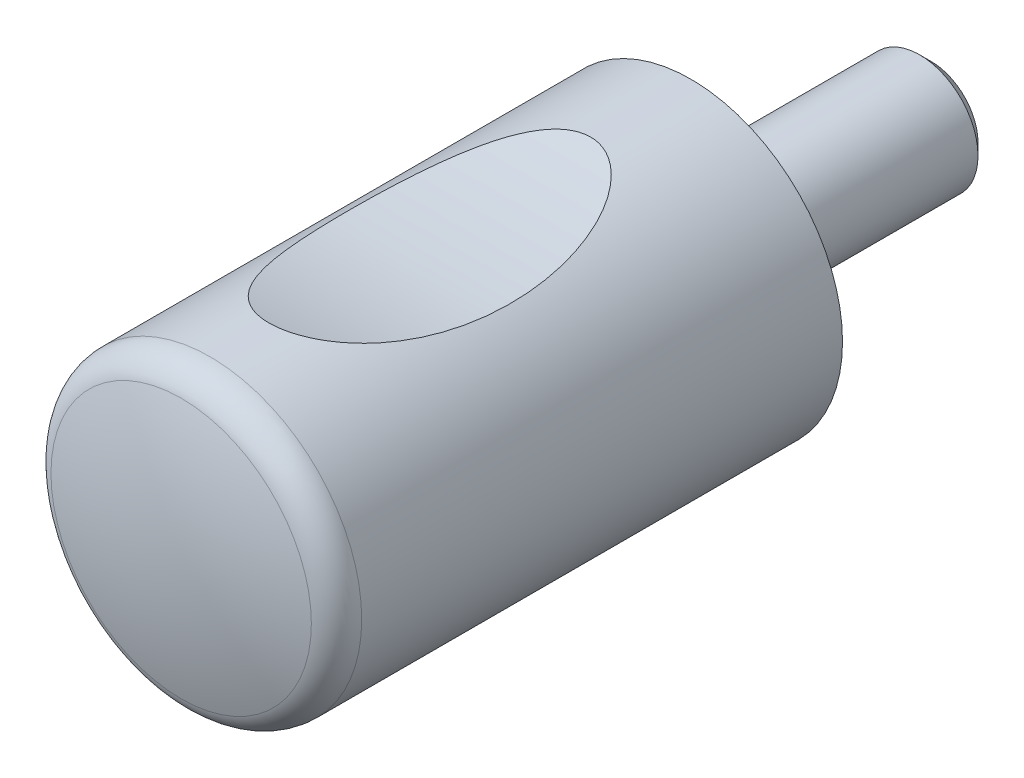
ISO-10303-21;
HEADER;
FILE_DESCRIPTION(('STEP AP214'),'2;1');
FILE_NAME('part.step','',(''),(''),'','','');
FILE_SCHEMA(('AUTOMOTIVE_DESIGN { 1 0 10303 214 1 1 1 1 }'));
ENDSEC;
DATA;
#1=APPLICATION_CONTEXT('core data for automotive mechanical design processes');
#2=APPLICATION_PROTOCOL_DEFINITION('international standard','automotive_design',2000,#1);
#3=PRODUCT_CONTEXT('',#1,'mechanical');
#4=PRODUCT('Part','Part','',(#3));
#5=PRODUCT_RELATED_PRODUCT_CATEGORY('part','',(#4));
#6=PRODUCT_DEFINITION_FORMATION('','',#4);
#7=PRODUCT_DEFINITION_CONTEXT('part definition',#1,'design');
#8=PRODUCT_DEFINITION('design','',#6,#7);
#9=PRODUCT_DEFINITION_SHAPE('','',#8);
#10=(LENGTH_UNIT() NAMED_UNIT(*) SI_UNIT(.MILLI.,.METRE.));
#11=(NAMED_UNIT(*) PLANE_ANGLE_UNIT() SI_UNIT($,.RADIAN.));
#12=(NAMED_UNIT(*) SI_UNIT($,.STERADIAN.) SOLID_ANGLE_UNIT());
#13=UNCERTAINTY_MEASURE_WITH_UNIT(LENGTH_MEASURE(1.E-05),#10,'distance_accuracy_value','');
#14=(GEOMETRIC_REPRESENTATION_CONTEXT(3) GLOBAL_UNCERTAINTY_ASSIGNED_CONTEXT((#13)) GLOBAL_UNIT_ASSIGNED_CONTEXT((#10,
#11,#12)) REPRESENTATION_CONTEXT('',''));
#15=CARTESIAN_POINT('',(0.,0.,0.));
#16=DIRECTION('',(0.,0.,1.));
#17=DIRECTION('',(1.,0.,0.));
#18=AXIS2_PLACEMENT_3D('',#15,#16,#17);
#19=CARTESIAN_POINT('',(0.,0.,23.));
#20=DIRECTION('',(0.,0.,1.));
#21=DIRECTION('',(1.,0.,0.));
#22=AXIS2_PLACEMENT_3D('',#19,#20,#21);
#23=CYLINDRICAL_SURFACE('',#22,6.5);
#24=CARTESIAN_POINT('',(0.,0.,20.916356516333));
#25=DIRECTION('',(0.,0.,1.));
#26=DIRECTION('',(1.,0.,0.));
#27=AXIS2_PLACEMENT_3D('',#24,#25,#26);
#28=CIRCLE('',#27,6.5);
#29=CARTESIAN_POINT('',(6.5,0.,20.916356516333));
#30=VERTEX_POINT('',#29);
#31=EDGE_CURVE('E188',#30,#30,#28,.T.);
#32=ORIENTED_EDGE('',*,*,#31,.F.);
#33=EDGE_LOOP('',(#32));
#34=FACE_BOUND('',#33,.T.);
#35=CARTESIAN_POINT('',(0.,-6.5,18.4));
#36=CARTESIAN_POINT('',(-0.115531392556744,-6.49999572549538,18.399988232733));
#37=CARTESIAN_POINT('',(-0.231125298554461,-6.49688153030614,18.3894938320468));
#38=CARTESIAN_POINT('',(-0.458423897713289,-6.48481797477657,18.3485443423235));
#39=CARTESIAN_POINT('',(-0.570123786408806,-6.47586165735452,18.3180654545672));
#40=CARTESIAN_POINT('',(-0.785793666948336,-6.45323298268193,18.2401488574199));
#41=CARTESIAN_POINT('',(-0.889817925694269,-6.43959858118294,18.1928475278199));
#42=CARTESIAN_POINT('',(-1.0896985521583,-6.40880655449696,18.084401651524));
#43=CARTESIAN_POINT('',(-1.18555212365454,-6.39164772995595,18.0232523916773));
#44=CARTESIAN_POINT('',(-1.42781079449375,-6.34310804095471,17.8470797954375));
#45=CARTESIAN_POINT('',(-1.56700173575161,-6.30968623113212,17.7227276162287));
#46=CARTESIAN_POINT('',(-1.8241387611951,-6.24022080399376,17.4542897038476));
#47=CARTESIAN_POINT('',(-1.94201763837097,-6.20416937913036,17.3101439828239));
#48=CARTESIAN_POINT('',(-2.14370437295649,-6.13710923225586,17.0300739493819));
#49=CARTESIAN_POINT('',(-2.22997335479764,-6.10611095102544,16.8958860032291));
#50=CARTESIAN_POINT('',(-2.39057992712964,-6.04504073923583,16.6202833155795));
#51=CARTESIAN_POINT('',(-2.46490873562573,-6.01496950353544,16.4788633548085));
#52=CARTESIAN_POINT('',(-2.60316489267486,-5.95643933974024,16.1905074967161));
#53=CARTESIAN_POINT('',(-2.66707785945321,-5.92798267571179,16.0435643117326));
#54=CARTESIAN_POINT('',(-2.78563730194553,-5.87319935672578,15.7455781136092));
#55=CARTESIAN_POINT('',(-2.84028048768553,-5.84687345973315,15.5945336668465));
#56=CARTESIAN_POINT('',(-2.98117382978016,-5.77692721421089,15.1689394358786));
#57=CARTESIAN_POINT('',(-3.05836928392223,-5.73603934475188,14.890921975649));
#58=CARTESIAN_POINT('',(-3.19072604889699,-5.66346974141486,14.328456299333));
#59=CARTESIAN_POINT('',(-3.24587054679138,-5.63179503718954,14.0440033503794));
#60=CARTESIAN_POINT('',(-3.33697489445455,-5.57829621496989,13.4705213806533));
#61=CARTESIAN_POINT('',(-3.37289285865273,-5.55649361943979,13.1814837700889));
#62=CARTESIAN_POINT('',(-3.42709645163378,-5.52322412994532,12.6012854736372));
#63=CARTESIAN_POINT('',(-3.44538698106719,-5.51175436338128,12.3101254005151));
#64=CARTESIAN_POINT('',(-3.46588728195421,-5.49889003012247,11.7072838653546));
#65=CARTESIAN_POINT('',(-3.46692559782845,-5.49822947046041,11.3955465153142));
#66=CARTESIAN_POINT('',(-3.44996569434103,-5.50888708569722,10.7726957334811));
#67=CARTESIAN_POINT('',(-3.43196163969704,-5.52020893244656,10.4615825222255));
#68=CARTESIAN_POINT('',(-3.37604581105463,-5.55458381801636,9.84291034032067));
#69=CARTESIAN_POINT('',(-3.33820666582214,-5.57759404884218,9.53534255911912));
#70=CARTESIAN_POINT('',(-3.240620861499,-5.63485565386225,8.92491898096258));
#71=CARTESIAN_POINT('',(-3.18088891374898,-5.66909947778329,8.62206016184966));
#72=CARTESIAN_POINT('',(-3.04130599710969,-5.74511613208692,8.04556476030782));
#73=CARTESIAN_POINT('',(-2.96324568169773,-5.78615527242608,7.77141079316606));
#74=CARTESIAN_POINT('',(-2.8264676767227,-5.85351346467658,7.36743393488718));
#75=CARTESIAN_POINT('',(-2.77751012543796,-5.87697024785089,7.23379930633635));
#76=CARTESIAN_POINT('',(-2.67229915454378,-5.92555400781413,6.96976033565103));
#77=CARTESIAN_POINT('',(-2.61604778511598,-5.95068051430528,6.83935509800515));
#78=CARTESIAN_POINT('',(-2.49459620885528,-6.00261688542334,6.58093717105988));
#79=CARTESIAN_POINT('',(-2.42928830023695,-6.02944450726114,6.45297830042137));
#80=CARTESIAN_POINT('',(-2.28920127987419,-6.08401313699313,6.20243063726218));
#81=CARTESIAN_POINT('',(-2.21441806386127,-6.11175453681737,6.0798442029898));
#82=CARTESIAN_POINT('',(-2.05454566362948,-6.16733129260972,5.84240042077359));
#83=CARTESIAN_POINT('',(-1.96950647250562,-6.19516559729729,5.72750951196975));
#84=CARTESIAN_POINT('',(-1.78762697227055,-6.25007237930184,5.50740131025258));
#85=CARTESIAN_POINT('',(-1.69080293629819,-6.27714584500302,5.40217102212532));
#86=CARTESIAN_POINT('',(-1.49396390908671,-6.32671731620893,5.21415856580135));
#87=CARTESIAN_POINT('',(-1.39514259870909,-6.34940519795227,5.13019169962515));
#88=CARTESIAN_POINT('',(-1.1862806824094,-6.39171931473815,4.97637545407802));
#89=CARTESIAN_POINT('',(-1.07624010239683,-6.41134555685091,4.90652604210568));
#90=CARTESIAN_POINT('',(-0.844075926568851,-6.44604093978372,4.7846335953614));
#91=CARTESIAN_POINT('',(-0.721822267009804,-6.46105208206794,4.7328161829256));
#92=CARTESIAN_POINT('',(-0.469126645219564,-6.48428070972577,4.65318609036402));
#93=CARTESIAN_POINT('',(-0.338700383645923,-6.49251081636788,4.62532880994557));
#94=CARTESIAN_POINT('',(-0.0910843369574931,-6.50039290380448,4.5986615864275));
#95=CARTESIAN_POINT('',(0.0257342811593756,-6.5009844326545,4.59666995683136));
#96=CARTESIAN_POINT('',(0.257679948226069,-6.49592582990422,4.6137700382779));
#97=CARTESIAN_POINT('',(0.37280676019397,-6.49027483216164,4.63286467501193));
#98=CARTESIAN_POINT('',(0.586741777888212,-6.47426816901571,4.68746218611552));
#99=CARTESIAN_POINT('',(0.686052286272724,-6.46441947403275,4.72120265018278));
#100=CARTESIAN_POINT('',(0.878533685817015,-6.44108596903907,4.8020659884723));
#101=CARTESIAN_POINT('',(0.971703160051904,-6.42760032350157,4.84919193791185));
#102=CARTESIAN_POINT('',(1.20205343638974,-6.38947674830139,4.9843592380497));
#103=CARTESIAN_POINT('',(1.33418007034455,-6.36285470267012,5.08043782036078));
#104=CARTESIAN_POINT('',(1.58128974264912,-6.30600619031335,5.29175320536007));
#105=CARTESIAN_POINT('',(1.69622197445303,-6.27576949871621,5.40704473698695));
#106=CARTESIAN_POINT('',(1.89109822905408,-6.21949148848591,5.62909492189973));
#107=CARTESIAN_POINT('',(1.97362288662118,-6.19366770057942,5.73368844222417));
#108=CARTESIAN_POINT('',(2.12914925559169,-6.14194176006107,5.94977060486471));
#109=CARTESIAN_POINT('',(2.20214457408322,-6.11603956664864,6.06126380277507));
#110=CARTESIAN_POINT('',(2.33966386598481,-6.06476402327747,6.28963163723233));
#111=CARTESIAN_POINT('',(2.40417684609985,-6.03939139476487,6.40651299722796));
#112=CARTESIAN_POINT('',(2.52555370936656,-5.9896466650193,6.64440860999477));
#113=CARTESIAN_POINT('',(2.58241471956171,-5.96527494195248,6.7654243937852));
#114=CARTESIAN_POINT('',(2.73286855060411,-5.89854030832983,7.11074906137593));
#115=CARTESIAN_POINT('',(2.8185936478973,-5.85771673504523,7.33880024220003));
#116=CARTESIAN_POINT('',(2.9711789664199,-5.78180786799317,7.80209100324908));
#117=CARTESIAN_POINT('',(3.03802434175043,-5.74672709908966,8.03733608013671));
#118=CARTESIAN_POINT('',(3.15559571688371,-5.68301789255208,8.51323544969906));
#119=CARTESIAN_POINT('',(3.20628365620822,-5.6544047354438,8.75390110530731));
#120=CARTESIAN_POINT('',(3.29322735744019,-5.60420781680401,9.23856138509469));
#121=CARTESIAN_POINT('',(3.32947946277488,-5.58262583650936,9.48255683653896));
#122=CARTESIAN_POINT('',(3.40201972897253,-5.5388491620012,10.0813354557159));
#123=CARTESIAN_POINT('',(3.43120135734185,-5.52062313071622,10.4372872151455));
#124=CARTESIAN_POINT('',(3.46433942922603,-5.49988126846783,11.1509701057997));
#125=CARTESIAN_POINT('',(3.46828081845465,-5.49737481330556,11.5087021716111));
#126=CARTESIAN_POINT('',(3.45117940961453,-5.50812699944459,12.2226366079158));
#127=CARTESIAN_POINT('',(3.43018532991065,-5.52135489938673,12.5788406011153));
#128=CARTESIAN_POINT('',(3.36185664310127,-5.56323646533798,13.2876584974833));
#129=CARTESIAN_POINT('',(3.31454205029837,-5.59187840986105,13.6402749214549));
#130=CARTESIAN_POINT('',(3.22066485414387,-5.64611269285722,14.1670529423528));
#131=CARTESIAN_POINT('',(3.18514900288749,-5.666292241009,14.3437924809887));
#132=CARTESIAN_POINT('',(3.1056585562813,-5.7102511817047,14.6948966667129));
#133=CARTESIAN_POINT('',(3.06168564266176,-5.73402985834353,14.8692617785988));
#134=CARTESIAN_POINT('',(2.96437631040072,-5.78493612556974,15.2148434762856));
#135=CARTESIAN_POINT('',(2.91104153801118,-5.81206312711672,15.3860606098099));
#136=CARTESIAN_POINT('',(2.79383147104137,-5.86930768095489,15.7243403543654));
#137=CARTESIAN_POINT('',(2.72995867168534,-5.89942452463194,15.8914039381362));
#138=CARTESIAN_POINT('',(2.60822191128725,-5.95402340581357,16.177536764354));
#139=CARTESIAN_POINT('',(2.55306359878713,-5.97795294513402,16.2978620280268));
#140=CARTESIAN_POINT('',(2.4353820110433,-6.02685485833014,16.5346237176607));
#141=CARTESIAN_POINT('',(2.37286077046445,-6.05182694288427,16.6510612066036));
#142=CARTESIAN_POINT('',(2.2396854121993,-6.10236647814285,16.8788258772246));
#143=CARTESIAN_POINT('',(2.16904497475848,-6.12793287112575,16.9901612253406));
#144=CARTESIAN_POINT('',(2.01861818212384,-6.17911703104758,17.2064012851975));
#145=CARTESIAN_POINT('',(1.93883775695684,-6.20473475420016,17.3113100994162));
#146=CARTESIAN_POINT('',(1.75644161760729,-6.259016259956,17.5277580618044));
#147=CARTESIAN_POINT('',(1.65219404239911,-6.28756830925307,17.6379729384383));
#148=CARTESIAN_POINT('',(1.42882490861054,-6.34205252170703,17.8430555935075));
#149=CARTESIAN_POINT('',(1.30971893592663,-6.36798737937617,17.9379392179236));
#150=CARTESIAN_POINT('',(1.08146512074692,-6.41023246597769,18.0895990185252));
#151=CARTESIAN_POINT('',(0.975050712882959,-6.42743097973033,18.1502010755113));
#152=CARTESIAN_POINT('',(0.75338345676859,-6.45715343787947,18.2538146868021));
#153=CARTESIAN_POINT('',(0.63814809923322,-6.46968635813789,18.2968600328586));
#154=CARTESIAN_POINT('',(0.435365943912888,-6.48595768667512,18.3524353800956));
#155=CARTESIAN_POINT('',(0.349355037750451,-6.49118740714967,18.3701762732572));
#156=CARTESIAN_POINT('',(0.175574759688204,-6.49821014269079,18.3939629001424));
#157=CARTESIAN_POINT('',(0.0878054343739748,-6.50000324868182,18.4000089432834));
#158=CARTESIAN_POINT('',(0.,-6.5,18.4));
#159=B_SPLINE_CURVE_WITH_KNOTS('',3,(#35,#36,#37,#38,#39,#40,#41,#42,#43,#44,#45,#46,#47,#48,
#49,#50,#51,#52,#53,#54,#55,#56,#57,#58,#59,#60,#61,#62,#63,#64,#65,#66,#67,#68,#69,#70,#71,#72,
#73,#74,#75,#76,#77,#78,#79,#80,#81,#82,#83,#84,#85,#86,#87,#88,#89,#90,#91,#92,#93,#94,#95,#96,
#97,#98,#99,#100,#101,#102,#103,#104,#105,#106,#107,#108,#109,#110,#111,#112,#113,#114,#115,
#116,#117,#118,#119,#120,#121,#122,#123,#124,#125,#126,#127,#128,#129,#130,#131,#132,#133,#134,
#135,#136,#137,#138,#139,#140,#141,#142,#143,#144,#145,#146,#147,#148,#149,#150,#151,#152,#153,
#154,#155,#156,#157,#158),.UNSPECIFIED.,.T.,.F.,(4,2,2,2,2,2,2,2,2,2,2,2,2,2,2,2,2,2,2,2,2,2,2,
2,2,2,2,2,2,2,2,2,2,2,2,2,2,2,2,2,2,2,2,2,2,2,2,2,2,2,2,2,2,2,2,2,2,2,2,2,2,4),(0.,
0.346216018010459,0.692845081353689,1.03672578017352,1.38072369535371,1.94632898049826,
2.51368790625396,3.00052953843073,3.48772761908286,3.97559280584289,4.46363078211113,
5.33651682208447,6.21006713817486,7.08551284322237,7.96071509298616,8.89511936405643,
9.82981005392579,10.7611019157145,11.6917691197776,12.5543797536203,12.9869159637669,
13.4193308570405,13.8574176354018,14.2956948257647,14.7319159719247,15.1675414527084,
15.5614466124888,15.9553508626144,16.3540201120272,16.7519456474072,17.1003818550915,
17.4488664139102,17.7637013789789,18.0786087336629,18.5723523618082,19.0675272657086,
19.4740891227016,19.8809223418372,20.2882777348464,20.6957856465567,21.4356719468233,
22.1761384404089,22.9183365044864,23.660722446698,24.7321719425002,25.8042604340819,
26.8742577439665,27.9434425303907,28.4874394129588,29.0313282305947,29.5751215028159,
30.1187861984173,30.5220986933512,30.9252999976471,31.3278316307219,31.7301035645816,
32.1920373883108,32.6534906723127,33.0231346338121,33.3920637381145,33.6551995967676,
33.9183284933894),.UNSPECIFIED.);
#160=CARTESIAN_POINT('',(0.,-6.5,18.4));
#161=VERTEX_POINT('',#160);
#162=EDGE_CURVE('E9',#161,#161,#159,.T.);
#163=ORIENTED_EDGE('',*,*,#162,.F.);
#164=EDGE_LOOP('',(#163));
#165=FACE_BOUND('',#164,.T.);
#166=CARTESIAN_POINT('',(0.,6.5,4.6));
#167=CARTESIAN_POINT('',(-0.115531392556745,6.49999572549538,4.60001176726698));
#168=CARTESIAN_POINT('',(-0.231125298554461,6.49688153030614,4.61050616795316));
#169=CARTESIAN_POINT('',(-0.458423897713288,6.48481797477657,4.65145565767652));
#170=CARTESIAN_POINT('',(-0.570123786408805,6.47586165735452,4.68193454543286));
#171=CARTESIAN_POINT('',(-0.785793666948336,6.45323298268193,4.75985114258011));
#172=CARTESIAN_POINT('',(-0.889817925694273,6.43959858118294,4.80715247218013));
#173=CARTESIAN_POINT('',(-1.0896985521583,6.40880655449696,4.91559834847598));
#174=CARTESIAN_POINT('',(-1.18555212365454,6.39164772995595,4.97674760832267));
#175=CARTESIAN_POINT('',(-1.42781079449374,6.34310804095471,5.15292020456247));
#176=CARTESIAN_POINT('',(-1.5670017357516,6.30968623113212,5.27727238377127));
#177=CARTESIAN_POINT('',(-1.8241387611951,6.24022080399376,5.54571029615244));
#178=CARTESIAN_POINT('',(-1.94201763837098,6.20416937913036,5.68985601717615));
#179=CARTESIAN_POINT('',(-2.1437043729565,6.13710923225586,5.96992605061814));
#180=CARTESIAN_POINT('',(-2.22997335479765,6.10611095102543,6.10411399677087));
#181=CARTESIAN_POINT('',(-2.39057992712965,6.04504073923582,6.37971668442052));
#182=CARTESIAN_POINT('',(-2.46490873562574,6.01496950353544,6.52113664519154));
#183=CARTESIAN_POINT('',(-2.60316489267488,5.95643933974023,6.80949250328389));
#184=CARTESIAN_POINT('',(-2.66707785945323,5.92798267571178,6.95643568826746));
#185=CARTESIAN_POINT('',(-2.78563730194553,5.87319935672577,7.25442188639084));
#186=CARTESIAN_POINT('',(-2.84028048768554,5.84687345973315,7.40546633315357));
#187=CARTESIAN_POINT('',(-2.98117382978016,5.77692721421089,7.83106056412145));
#188=CARTESIAN_POINT('',(-3.05836928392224,5.73603934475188,8.10907802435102));
#189=CARTESIAN_POINT('',(-3.190726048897,5.66346974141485,8.67154370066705));
#190=CARTESIAN_POINT('',(-3.24587054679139,5.63179503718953,8.95599664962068));
#191=CARTESIAN_POINT('',(-3.33697489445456,5.57829621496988,9.52947861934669));
#192=CARTESIAN_POINT('',(-3.37289285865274,5.55649361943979,9.81851622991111));
#193=CARTESIAN_POINT('',(-3.42709645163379,5.52322412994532,10.3987145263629));
#194=CARTESIAN_POINT('',(-3.44538698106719,5.51175436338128,10.689874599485));
#195=CARTESIAN_POINT('',(-3.46588728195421,5.49889003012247,11.2927161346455));
#196=CARTESIAN_POINT('',(-3.46692559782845,5.49822947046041,11.6044534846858));
#197=CARTESIAN_POINT('',(-3.44996569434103,5.50888708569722,12.2273042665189));
#198=CARTESIAN_POINT('',(-3.43196163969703,5.52020893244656,12.5384174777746));
#199=CARTESIAN_POINT('',(-3.37604581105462,5.55458381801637,13.1570896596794));
#200=CARTESIAN_POINT('',(-3.33820666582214,5.57759404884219,13.4646574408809));
#201=CARTESIAN_POINT('',(-3.240620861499,5.63485565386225,14.0750810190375));
#202=CARTESIAN_POINT('',(-3.18088891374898,5.66909947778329,14.3779398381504));
#203=CARTESIAN_POINT('',(-3.04130599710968,5.74511613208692,14.9544352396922));
#204=CARTESIAN_POINT('',(-2.96324568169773,5.78615527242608,15.228589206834));
#205=CARTESIAN_POINT('',(-2.8264676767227,5.85351346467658,15.6325660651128));
#206=CARTESIAN_POINT('',(-2.77751012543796,5.87697024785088,15.7662006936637));
#207=CARTESIAN_POINT('',(-2.67229915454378,5.92555400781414,16.030239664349));
#208=CARTESIAN_POINT('',(-2.61604778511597,5.95068051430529,16.1606449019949));
#209=CARTESIAN_POINT('',(-2.49459620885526,6.00261688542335,16.4190628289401));
#210=CARTESIAN_POINT('',(-2.42928830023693,6.02944450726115,16.5470216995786));
#211=CARTESIAN_POINT('',(-2.28920127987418,6.08401313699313,16.7975693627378));
#212=CARTESIAN_POINT('',(-2.21441806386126,6.11175453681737,16.9201557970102));
#213=CARTESIAN_POINT('',(-2.05454566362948,6.16733129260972,17.1575995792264));
#214=CARTESIAN_POINT('',(-1.96950647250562,6.19516559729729,17.2724904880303));
#215=CARTESIAN_POINT('',(-1.78762697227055,6.25007237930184,17.4925986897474));
#216=CARTESIAN_POINT('',(-1.69080293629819,6.27714584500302,17.5978289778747));
#217=CARTESIAN_POINT('',(-1.49396390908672,6.32671731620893,17.7858414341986));
#218=CARTESIAN_POINT('',(-1.3951425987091,6.34940519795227,17.8698083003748));
#219=CARTESIAN_POINT('',(-1.1862806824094,6.39171931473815,18.023624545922));
#220=CARTESIAN_POINT('',(-1.07624010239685,6.41134555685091,18.0934739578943));
#221=CARTESIAN_POINT('',(-0.844075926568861,6.44604093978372,18.2153664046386));
#222=CARTESIAN_POINT('',(-0.721822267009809,6.46105208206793,18.2671838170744));
#223=CARTESIAN_POINT('',(-0.469126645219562,6.48428070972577,18.346813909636));
#224=CARTESIAN_POINT('',(-0.33870038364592,6.49251081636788,18.3746711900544));
#225=CARTESIAN_POINT('',(-0.09108433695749,6.50039290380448,18.4013384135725));
#226=CARTESIAN_POINT('',(0.0257342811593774,6.5009844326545,18.4033300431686));
#227=CARTESIAN_POINT('',(0.257679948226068,6.49592582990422,18.3862299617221));
#228=CARTESIAN_POINT('',(0.372806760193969,6.49027483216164,18.3671353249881));
#229=CARTESIAN_POINT('',(0.586741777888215,6.47426816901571,18.3125378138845));
#230=CARTESIAN_POINT('',(0.686052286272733,6.46441947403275,18.2787973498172));
#231=CARTESIAN_POINT('',(0.878533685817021,6.44108596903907,18.1979340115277));
#232=CARTESIAN_POINT('',(0.971703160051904,6.42760032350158,18.1508080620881));
#233=CARTESIAN_POINT('',(1.20205343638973,6.3894767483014,18.0156407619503));
#234=CARTESIAN_POINT('',(1.33418007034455,6.36285470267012,17.9195621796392));
#235=CARTESIAN_POINT('',(1.58128974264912,6.30600619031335,17.7082467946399));
#236=CARTESIAN_POINT('',(1.69622197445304,6.27576949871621,17.592955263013));
#237=CARTESIAN_POINT('',(1.89109822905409,6.21949148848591,17.3709050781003));
#238=CARTESIAN_POINT('',(1.97362288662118,6.19366770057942,17.2663115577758));
#239=CARTESIAN_POINT('',(2.12914925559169,6.14194176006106,17.0502293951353));
#240=CARTESIAN_POINT('',(2.20214457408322,6.11603956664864,16.9387361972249));
#241=CARTESIAN_POINT('',(2.33966386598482,6.06476402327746,16.7103683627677));
#242=CARTESIAN_POINT('',(2.40417684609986,6.03939139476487,16.593487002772));
#243=CARTESIAN_POINT('',(2.52555370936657,5.9896466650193,16.3555913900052));
#244=CARTESIAN_POINT('',(2.5824147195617,5.96527494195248,16.2345756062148));
#245=CARTESIAN_POINT('',(2.7328685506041,5.89854030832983,15.8892509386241));
#246=CARTESIAN_POINT('',(2.81859364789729,5.85771673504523,15.6611997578));
#247=CARTESIAN_POINT('',(2.9711789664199,5.78180786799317,15.1979089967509));
#248=CARTESIAN_POINT('',(3.03802434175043,5.74672709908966,14.9626639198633));
#249=CARTESIAN_POINT('',(3.15559571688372,5.68301789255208,14.4867645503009));
#250=CARTESIAN_POINT('',(3.20628365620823,5.65440473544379,14.2460988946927));
#251=CARTESIAN_POINT('',(3.29322735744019,5.60420781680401,13.7614386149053));
#252=CARTESIAN_POINT('',(3.32947946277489,5.58262583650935,13.517443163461));
#253=CARTESIAN_POINT('',(3.40201972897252,5.53884916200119,12.9186645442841));
#254=CARTESIAN_POINT('',(3.43120135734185,5.52062313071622,12.5627127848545));
#255=CARTESIAN_POINT('',(3.46433942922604,5.49988126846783,11.8490298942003));
#256=CARTESIAN_POINT('',(3.46828081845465,5.49737481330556,11.4912978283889));
#257=CARTESIAN_POINT('',(3.45117940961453,5.50812699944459,10.7773633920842));
#258=CARTESIAN_POINT('',(3.43018532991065,5.52135489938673,10.4211593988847));
#259=CARTESIAN_POINT('',(3.36185664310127,5.56323646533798,9.71234150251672));
#260=CARTESIAN_POINT('',(3.31454205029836,5.59187840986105,9.35972507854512));
#261=CARTESIAN_POINT('',(3.22066485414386,5.64611269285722,8.83294705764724));
#262=CARTESIAN_POINT('',(3.18514900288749,5.666292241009,8.65620751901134));
#263=CARTESIAN_POINT('',(3.1056585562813,5.7102511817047,8.3051033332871));
#264=CARTESIAN_POINT('',(3.06168564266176,5.73402985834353,8.13073822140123));
#265=CARTESIAN_POINT('',(2.96437631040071,5.78493612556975,7.78515652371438));
#266=CARTESIAN_POINT('',(2.91104153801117,5.81206312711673,7.61393939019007));
#267=CARTESIAN_POINT('',(2.79383147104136,5.86930768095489,7.27565964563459));
#268=CARTESIAN_POINT('',(2.72995867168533,5.89942452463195,7.10859606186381));
#269=CARTESIAN_POINT('',(2.60822191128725,5.95402340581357,6.82246323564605));
#270=CARTESIAN_POINT('',(2.55306359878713,5.97795294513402,6.70213797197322));
#271=CARTESIAN_POINT('',(2.4353820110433,6.02685485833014,6.46537628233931));
#272=CARTESIAN_POINT('',(2.37286077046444,6.05182694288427,6.34893879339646));
#273=CARTESIAN_POINT('',(2.2396854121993,6.10236647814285,6.12117412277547));
#274=CARTESIAN_POINT('',(2.16904497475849,6.12793287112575,6.00983877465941));
#275=CARTESIAN_POINT('',(2.01861818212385,6.17911703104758,5.79359871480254));
#276=CARTESIAN_POINT('',(1.93883775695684,6.20473475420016,5.68868990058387));
#277=CARTESIAN_POINT('',(1.75644161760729,6.259016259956,5.47224193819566));
#278=CARTESIAN_POINT('',(1.65219404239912,6.28756830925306,5.36202706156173));
#279=CARTESIAN_POINT('',(1.42882490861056,6.34205252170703,5.15694440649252));
#280=CARTESIAN_POINT('',(1.30971893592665,6.36798737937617,5.06206078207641));
#281=CARTESIAN_POINT('',(1.08146512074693,6.41023246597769,4.91040098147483));
#282=CARTESIAN_POINT('',(0.975050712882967,6.42743097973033,4.84979892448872));
#283=CARTESIAN_POINT('',(0.753383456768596,6.45715343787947,4.74618531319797));
#284=CARTESIAN_POINT('',(0.638148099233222,6.46968635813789,4.70313996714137));
#285=CARTESIAN_POINT('',(0.435365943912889,6.48595768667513,4.64756461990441));
#286=CARTESIAN_POINT('',(0.349355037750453,6.49118740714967,4.62982372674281));
#287=CARTESIAN_POINT('',(0.175574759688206,6.49821014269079,4.60603709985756));
#288=CARTESIAN_POINT('',(0.0878054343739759,6.50000324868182,4.59999105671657));
#289=CARTESIAN_POINT('',(0.,6.5,4.6));
#290=B_SPLINE_CURVE_WITH_KNOTS('',3,(#166,#167,#168,#169,#170,#171,#172,#173,#174,#175,#176,
#177,#178,#179,#180,#181,#182,#183,#184,#185,#186,#187,#188,#189,#190,#191,#192,#193,#194,#195,
#196,#197,#198,#199,#200,#201,#202,#203,#204,#205,#206,#207,#208,#209,#210,#211,#212,#213,#214,
#215,#216,#217,#218,#219,#220,#221,#222,#223,#224,#225,#226,#227,#228,#229,#230,#231,#232,#233,
#234,#235,#236,#237,#238,#239,#240,#241,#242,#243,#244,#245,#246,#247,#248,#249,#250,#251,#252,
#253,#254,#255,#256,#257,#258,#259,#260,#261,#262,#263,#264,#265,#266,#267,#268,#269,#270,#271,
#272,#273,#274,#275,#276,#277,#278,#279,#280,#281,#282,#283,#284,#285,#286,#287,#288,#289),
.UNSPECIFIED.,.T.,.F.,(4,2,2,2,2,2,2,2,2,2,2,2,2,2,2,2,2,2,2,2,2,2,2,2,2,2,2,2,2,2,2,2,2,2,2,2,
2,2,2,2,2,2,2,2,2,2,2,2,2,2,2,2,2,2,2,2,2,2,2,2,2,4),(0.,0.346216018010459,0.692845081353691,
1.03672578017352,1.38072369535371,1.94632898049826,2.51368790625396,3.00052953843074,
3.48772761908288,3.97559280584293,4.46363078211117,5.33651682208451,6.2100671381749,
7.08551284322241,7.96071509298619,8.89511936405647,9.82981005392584,10.7611019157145,
11.6917691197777,12.5543797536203,12.9869159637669,13.4193308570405,13.8574176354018,
14.2956948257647,14.7319159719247,15.1675414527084,15.5614466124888,15.9553508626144,
16.3540201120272,16.7519456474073,17.1003818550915,17.4488664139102,17.7637013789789,
18.0786087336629,18.5723523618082,19.0675272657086,19.4740891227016,19.8809223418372,
20.2882777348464,20.6957856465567,21.4356719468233,22.1761384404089,22.9183365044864,
23.660722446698,24.7321719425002,25.804260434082,26.8742577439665,27.9434425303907,
28.4874394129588,29.0313282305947,29.5751215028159,30.1187861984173,30.5220986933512,
30.9252999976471,31.3278316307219,31.7301035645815,32.1920373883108,32.6534906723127,
33.0231346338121,33.3920637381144,33.6551995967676,33.9183284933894),.UNSPECIFIED.);
#291=CARTESIAN_POINT('',(0.,6.5,4.6));
#292=VERTEX_POINT('',#291);
#293=EDGE_CURVE('E27',#292,#292,#290,.T.);
#294=ORIENTED_EDGE('',*,*,#293,.F.);
#295=EDGE_LOOP('',(#294));
#296=FACE_BOUND('',#295,.T.);
#297=CARTESIAN_POINT('',(0.,0.,0.3));
#298=DIRECTION('',(0.,0.,1.));
#299=DIRECTION('',(1.,0.,0.));
#300=AXIS2_PLACEMENT_3D('',#297,#298,#299);
#301=CIRCLE('',#300,6.5);
#302=CARTESIAN_POINT('',(6.5,0.,0.3));
#303=VERTEX_POINT('',#302);
#304=EDGE_CURVE('E191',#303,#303,#301,.T.);
#305=ORIENTED_EDGE('',*,*,#304,.T.);
#306=EDGE_LOOP('',(#305));
#307=FACE_BOUND('',#306,.T.);
#308=ADVANCED_FACE('F14',(#34,#165,#296,#307),#23,.T.);
#309=CARTESIAN_POINT('',(0.,0.,-7.5));
#310=DIRECTION('',(0.,0.,1.));
#311=DIRECTION('',(1.,0.,0.));
#312=AXIS2_PLACEMENT_3D('',#309,#310,#311);
#313=PLANE('',#312);
#314=CARTESIAN_POINT('',(0.,0.,-7.5));
#315=DIRECTION('',(0.,0.,1.));
#316=DIRECTION('',(1.,0.,0.));
#317=AXIS2_PLACEMENT_3D('',#314,#315,#316);
#318=CIRCLE('',#317,1.25);
#319=CARTESIAN_POINT('',(0.625,-1.08253175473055,-7.5));
#320=VERTEX_POINT('',#319);
#321=CARTESIAN_POINT('',(-0.625,-1.08253175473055,-7.5));
#322=VERTEX_POINT('',#321);
#323=EDGE_CURVE('E200',#320,#322,#318,.F.);
#324=ORIENTED_EDGE('',*,*,#323,.F.);
#325=DIRECTION('',(0.866025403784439,0.5,0.));
#326=VECTOR('',#325,1.);
#327=CARTESIAN_POINT('',(0.,-1.44337567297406,-7.5));
#328=LINE('',#327,#326);
#329=CARTESIAN_POINT('',(0.,-1.44337567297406,-7.5));
#330=VERTEX_POINT('',#329);
#331=EDGE_CURVE('E130',#330,#320,#328,.T.);
#332=ORIENTED_EDGE('',*,*,#331,.F.);
#333=DIRECTION('',(0.866025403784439,-0.5,0.));
#334=VECTOR('',#333,1.);
#335=CARTESIAN_POINT('',(-1.25,-0.721687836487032,-7.5));
#336=LINE('',#335,#334);
#337=EDGE_CURVE('E125',#322,#330,#336,.T.);
#338=ORIENTED_EDGE('',*,*,#337,.F.);
#339=EDGE_LOOP('',(#324,#332,#338));
#340=FACE_BOUND('',#339,.T.);
#341=ADVANCED_FACE('F215',(#340),#313,.F.);
#342=CARTESIAN_POINT('',(-1.25,0.,-7.5));
#343=VERTEX_POINT('',#342);
#344=EDGE_CURVE('E102',#322,#343,#318,.F.);
#345=ORIENTED_EDGE('',*,*,#344,.F.);
#346=CARTESIAN_POINT('',(-1.25,-0.721687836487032,-7.5));
#347=VERTEX_POINT('',#346);
#348=EDGE_CURVE('E126',#347,#322,#336,.T.);
#349=ORIENTED_EDGE('',*,*,#348,.F.);
#350=DIRECTION('',(0.,-1.,0.));
#351=VECTOR('',#350,1.);
#352=CARTESIAN_POINT('',(-1.25,0.721687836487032,-7.5));
#353=LINE('',#352,#351);
#354=EDGE_CURVE('E122',#343,#347,#353,.T.);
#355=ORIENTED_EDGE('',*,*,#354,.F.);
#356=EDGE_LOOP('',(#345,#349,#355));
#357=FACE_BOUND('',#356,.T.);
#358=ADVANCED_FACE('F218',(#357),#313,.F.);
#359=CARTESIAN_POINT('',(-0.625,1.08253175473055,-7.5));
#360=VERTEX_POINT('',#359);
#361=EDGE_CURVE('E99',#343,#360,#318,.F.);
#362=ORIENTED_EDGE('',*,*,#361,.F.);
#363=CARTESIAN_POINT('',(-1.25,0.721687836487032,-7.5));
#364=VERTEX_POINT('',#363);
#365=EDGE_CURVE('E112',#364,#343,#353,.T.);
#366=ORIENTED_EDGE('',*,*,#365,.F.);
#367=DIRECTION('',(-0.866025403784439,-0.5,0.));
#368=VECTOR('',#367,1.);
#369=CARTESIAN_POINT('',(0.,1.44337567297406,-7.5));
#370=LINE('',#369,#368);
#371=EDGE_CURVE('E108',#360,#364,#370,.T.);
#372=ORIENTED_EDGE('',*,*,#371,.F.);
#373=EDGE_LOOP('',(#362,#366,#372));
#374=FACE_BOUND('',#373,.T.);
#375=ADVANCED_FACE('F110',(#374),#313,.F.);
#376=CARTESIAN_POINT('',(0.625,1.08253175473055,-7.5));
#377=VERTEX_POINT('',#376);
#378=EDGE_CURVE('E34',#360,#377,#318,.F.);
#379=ORIENTED_EDGE('',*,*,#378,.F.);
#380=CARTESIAN_POINT('',(0.,1.44337567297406,-7.5));
#381=VERTEX_POINT('',#380);
#382=EDGE_CURVE('E114',#381,#360,#370,.T.);
#383=ORIENTED_EDGE('',*,*,#382,.F.);
#384=DIRECTION('',(-0.866025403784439,0.5,0.));
#385=VECTOR('',#384,1.);
#386=CARTESIAN_POINT('',(1.25,0.721687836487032,-7.5));
#387=LINE('',#386,#385);
#388=EDGE_CURVE('E137',#377,#381,#387,.T.);
#389=ORIENTED_EDGE('',*,*,#388,.F.);
#390=EDGE_LOOP('',(#379,#383,#389));
#391=FACE_BOUND('',#390,.T.);
#392=ADVANCED_FACE('F318',(#391),#313,.F.);
#393=CARTESIAN_POINT('',(1.25,0.,-7.5));
#394=VERTEX_POINT('',#393);
#395=EDGE_CURVE('E106',#394,#320,#318,.F.);
#396=ORIENTED_EDGE('',*,*,#395,.F.);
#397=DIRECTION('',(0.,1.,0.));
#398=VECTOR('',#397,1.);
#399=CARTESIAN_POINT('',(1.25,-0.721687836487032,-7.5));
#400=LINE('',#399,#398);
#401=CARTESIAN_POINT('',(1.25,-0.721687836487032,-7.5));
#402=VERTEX_POINT('',#401);
#403=EDGE_CURVE('E134',#402,#394,#400,.T.);
#404=ORIENTED_EDGE('',*,*,#403,.F.);
#405=EDGE_CURVE('E129',#320,#402,#328,.T.);
#406=ORIENTED_EDGE('',*,*,#405,.F.);
#407=EDGE_LOOP('',(#396,#404,#406));
#408=FACE_BOUND('',#407,.T.);
#409=ADVANCED_FACE('F327',(#408),#313,.F.);
#410=EDGE_CURVE('E199',#377,#394,#318,.F.);
#411=ORIENTED_EDGE('',*,*,#410,.F.);
#412=CARTESIAN_POINT('',(1.25,0.721687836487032,-7.5));
#413=VERTEX_POINT('',#412);
#414=EDGE_CURVE('E138',#413,#377,#387,.T.);
#415=ORIENTED_EDGE('',*,*,#414,.F.);
#416=EDGE_CURVE('E133',#394,#413,#400,.T.);
#417=ORIENTED_EDGE('',*,*,#416,.F.);
#418=EDGE_LOOP('',(#411,#415,#417));
#419=FACE_BOUND('',#418,.T.);
#420=ADVANCED_FACE('F220',(#419),#313,.F.);
#421=CARTESIAN_POINT('',(0.,0.,-10.));
#422=DIRECTION('',(0.,0.,1.));
#423=DIRECTION('',(1.,0.,0.));
#424=AXIS2_PLACEMENT_3D('',#421,#422,#423);
#425=PLANE('',#424);
#426=CARTESIAN_POINT('',(0.,0.,-10.));
#427=DIRECTION('',(0.,0.,1.));
#428=DIRECTION('',(1.,0.,0.));
#429=AXIS2_PLACEMENT_3D('',#426,#427,#428);
#430=CIRCLE('',#429,2.0095);
#431=CARTESIAN_POINT('',(2.0095,0.,-10.));
#432=VERTEX_POINT('',#431);
#433=EDGE_CURVE('E182',#432,#432,#430,.T.);
#434=ORIENTED_EDGE('',*,*,#433,.F.);
#435=EDGE_LOOP('',(#434));
#436=FACE_BOUND('',#435,.T.);
#437=DIRECTION('',(-0.866025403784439,-0.5,0.));
#438=VECTOR('',#437,1.);
#439=CARTESIAN_POINT('',(0.,1.44337567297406,-10.));
#440=LINE('',#439,#438);
#441=CARTESIAN_POINT('',(0.,1.44337567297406,-10.));
#442=VERTEX_POINT('',#441);
#443=CARTESIAN_POINT('',(-1.25,0.721687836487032,-10.));
#444=VERTEX_POINT('',#443);
#445=EDGE_CURVE('E42',#442,#444,#440,.T.);
#446=ORIENTED_EDGE('',*,*,#445,.T.);
#447=DIRECTION('',(0.,-1.,0.));
#448=VECTOR('',#447,1.);
#449=CARTESIAN_POINT('',(-1.25,0.721687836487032,-10.));
#450=LINE('',#449,#448);
#451=CARTESIAN_POINT('',(-1.25,-0.721687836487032,-10.));
#452=VERTEX_POINT('',#451);
#453=EDGE_CURVE('E142',#444,#452,#450,.T.);
#454=ORIENTED_EDGE('',*,*,#453,.T.);
#455=DIRECTION('',(0.866025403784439,-0.5,0.));
#456=VECTOR('',#455,1.);
#457=CARTESIAN_POINT('',(-1.25,-0.721687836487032,-10.));
#458=LINE('',#457,#456);
#459=CARTESIAN_POINT('',(0.,-1.44337567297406,-10.));
#460=VERTEX_POINT('',#459);
#461=EDGE_CURVE('E145',#452,#460,#458,.T.);
#462=ORIENTED_EDGE('',*,*,#461,.T.);
#463=DIRECTION('',(0.866025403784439,0.5,0.));
#464=VECTOR('',#463,1.);
#465=CARTESIAN_POINT('',(0.,-1.44337567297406,-10.));
#466=LINE('',#465,#464);
#467=CARTESIAN_POINT('',(1.25,-0.721687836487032,-10.));
#468=VERTEX_POINT('',#467);
#469=EDGE_CURVE('E148',#460,#468,#466,.T.);
#470=ORIENTED_EDGE('',*,*,#469,.T.);
#471=DIRECTION('',(0.,1.,0.));
#472=VECTOR('',#471,1.);
#473=CARTESIAN_POINT('',(1.25,-0.721687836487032,-10.));
#474=LINE('',#473,#472);
#475=CARTESIAN_POINT('',(1.25,0.721687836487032,-10.));
#476=VERTEX_POINT('',#475);
#477=EDGE_CURVE('E151',#468,#476,#474,.T.);
#478=ORIENTED_EDGE('',*,*,#477,.T.);
#479=DIRECTION('',(-0.866025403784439,0.5,0.));
#480=VECTOR('',#479,1.);
#481=CARTESIAN_POINT('',(1.25,0.721687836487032,-10.));
#482=LINE('',#481,#480);
#483=EDGE_CURVE('E115',#476,#442,#482,.T.);
#484=ORIENTED_EDGE('',*,*,#483,.T.);
#485=EDGE_LOOP('',(#446,#454,#462,#470,#478,#484));
#486=FACE_BOUND('',#485,.T.);
#487=ADVANCED_FACE('F263',(#436,#486),#425,.F.);
#488=CARTESIAN_POINT('',(0.,0.,0.));
#489=DIRECTION('',(0.,0.,1.));
#490=DIRECTION('',(1.,0.,0.));
#491=AXIS2_PLACEMENT_3D('',#488,#489,#490);
#492=PLANE('',#491);
#493=CARTESIAN_POINT('',(0.,0.,0.));
#494=DIRECTION('',(0.,0.,1.));
#495=DIRECTION('',(1.,0.,0.));
#496=AXIS2_PLACEMENT_3D('',#493,#494,#495);
#497=CIRCLE('',#496,3.25);
#498=CARTESIAN_POINT('',(3.25,0.,0.));
#499=VERTEX_POINT('',#498);
#500=EDGE_CURVE('E197',#499,#499,#497,.T.);
#501=ORIENTED_EDGE('',*,*,#500,.F.);
#502=EDGE_LOOP('',(#501));
#503=FACE_BOUND('',#502,.T.);
#504=CARTESIAN_POINT('',(0.,0.,0.));
#505=DIRECTION('',(0.,0.,1.));
#506=DIRECTION('',(1.,0.,0.));
#507=AXIS2_PLACEMENT_3D('',#504,#505,#506);
#508=CIRCLE('',#507,1.9);
#509=CARTESIAN_POINT('',(1.9,0.,0.));
#510=VERTEX_POINT('',#509);
#511=EDGE_CURVE('E167',#510,#510,#508,.T.);
#512=ORIENTED_EDGE('',*,*,#511,.T.);
#513=EDGE_LOOP('',(#512));
#514=FACE_BOUND('',#513,.T.);
#515=ADVANCED_FACE('F16',(#503,#514),#492,.F.);
#516=CARTESIAN_POINT('',(0.,0.,23.));
#517=DIRECTION('',(0.,0.,1.));
#518=DIRECTION('',(1.,0.,0.));
#519=AXIS2_PLACEMENT_3D('',#516,#517,#518);
#520=CYLINDRICAL_SURFACE('',#519,3.25);
#521=CARTESIAN_POINT('',(0.,0.,0.3));
#522=DIRECTION('',(0.,0.,1.));
#523=DIRECTION('',(1.,0.,0.));
#524=AXIS2_PLACEMENT_3D('',#521,#522,#523);
#525=CIRCLE('',#524,3.25);
#526=CARTESIAN_POINT('',(3.25,0.,0.3));
#527=VERTEX_POINT('',#526);
#528=EDGE_CURVE('E194',#527,#527,#525,.T.);
#529=ORIENTED_EDGE('',*,*,#528,.F.);
#530=EDGE_LOOP('',(#529));
#531=FACE_BOUND('',#530,.T.);
#532=ORIENTED_EDGE('',*,*,#500,.T.);
#533=EDGE_LOOP('',(#532));
#534=FACE_BOUND('',#533,.T.);
#535=ADVANCED_FACE('F278',(#531,#534),#520,.T.);
#536=CARTESIAN_POINT('',(0.,3.25,0.3));
#537=DIRECTION('',(0.,0.,1.));
#538=DIRECTION('',(1.,0.,0.));
#539=AXIS2_PLACEMENT_3D('',#536,#537,#538);
#540=PLANE('',#539);
#541=ORIENTED_EDGE('',*,*,#304,.F.);
#542=EDGE_LOOP('',(#541));
#543=FACE_BOUND('',#542,.T.);
#544=ORIENTED_EDGE('',*,*,#528,.T.);
#545=EDGE_LOOP('',(#544));
#546=FACE_BOUND('',#545,.T.);
#547=ADVANCED_FACE('F271',(#543,#546),#540,.F.);
#548=CARTESIAN_POINT('',(0.,0.,20.916356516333));
#549=DIRECTION('',(0.,0.,1.));
#550=DIRECTION('',(1.,0.,0.));
#551=AXIS2_PLACEMENT_3D('',#548,#549,#550);
#552=TOROIDAL_SURFACE('',#551,5.2,1.30000000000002);
#553=ORIENTED_EDGE('',*,*,#31,.T.);
#554=EDGE_LOOP('',(#553));
#555=FACE_BOUND('',#554,.T.);
#556=CARTESIAN_POINT('',(0.,0.,22.1586199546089));
#557=DIRECTION('',(0.,0.,1.));
#558=DIRECTION('',(1.,0.,0.));
#559=AXIS2_PLACEMENT_3D('',#556,#557,#558);
#560=CIRCLE('',#559,5.58312080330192);
#561=CARTESIAN_POINT('',(5.58312080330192,0.,22.1586199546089));
#562=VERTEX_POINT('',#561);
#563=EDGE_CURVE('E185',#562,#562,#560,.T.);
#564=ORIENTED_EDGE('',*,*,#563,.F.);
#565=EDGE_LOOP('',(#564));
#566=FACE_BOUND('',#565,.T.);
#567=ADVANCED_FACE('F268',(#555,#566),#552,.T.);
#568=CARTESIAN_POINT('',(0.,0.,4.0554347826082));
#569=DIRECTION('',(0.,0.,1.));
#570=DIRECTION('',(0.,-1.,0.));
#571=AXIS2_PLACEMENT_3D('',#568,#569,#570);
#572=SPHERICAL_SURFACE('',#571,18.9445652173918);
#573=ORIENTED_EDGE('',*,*,#563,.T.);
#574=EDGE_LOOP('',(#573));
#575=FACE_BOUND('',#574,.T.);
#576=ADVANCED_FACE('F261',(#575),#572,.T.);
#577=CARTESIAN_POINT('',(0.,0.,-10.));
#578=DIRECTION('',(0.,0.,1.));
#579=DIRECTION('',(1.,0.,0.));
#580=AXIS2_PLACEMENT_3D('',#577,#578,#579);
#581=CONICAL_SURFACE('',#580,2.0095,0.785398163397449);
#582=CARTESIAN_POINT('',(0.,0.,-9.5095));
#583=DIRECTION('',(0.,0.,1.));
#584=DIRECTION('',(1.,0.,0.));
#585=AXIS2_PLACEMENT_3D('',#582,#583,#584);
#586=CIRCLE('',#585,2.5);
#587=CARTESIAN_POINT('',(2.5,0.,-9.5095));
#588=VERTEX_POINT('',#587);
#589=EDGE_CURVE('E179',#588,#588,#586,.T.);
#590=ORIENTED_EDGE('',*,*,#589,.F.);
#591=EDGE_LOOP('',(#590));
#592=FACE_BOUND('',#591,.T.);
#593=ORIENTED_EDGE('',*,*,#433,.T.);
#594=EDGE_LOOP('',(#593));
#595=FACE_BOUND('',#594,.T.);
#596=ADVANCED_FACE('F257',(#592,#595),#581,.T.);
#597=CARTESIAN_POINT('',(0.,0.,0.));
#598=DIRECTION('',(0.,0.,1.));
#599=DIRECTION('',(1.,0.,0.));
#600=AXIS2_PLACEMENT_3D('',#597,#598,#599);
#601=CYLINDRICAL_SURFACE('',#600,2.5);
#602=CARTESIAN_POINT('',(0.,0.,-1.4905));
#603=DIRECTION('',(0.,0.,1.));
#604=DIRECTION('',(1.,0.,0.));
#605=AXIS2_PLACEMENT_3D('',#602,#603,#604);
#606=CIRCLE('',#605,2.5);
#607=CARTESIAN_POINT('',(2.5,0.,-1.4905));
#608=VERTEX_POINT('',#607);
#609=EDGE_CURVE('E176',#608,#608,#606,.T.);
#610=ORIENTED_EDGE('',*,*,#609,.F.);
#611=EDGE_LOOP('',(#610));
#612=FACE_BOUND('',#611,.T.);
#613=ORIENTED_EDGE('',*,*,#589,.T.);
#614=EDGE_LOOP('',(#613));
#615=FACE_BOUND('',#614,.T.);
#616=ADVANCED_FACE('F253',(#612,#615),#601,.T.);
#617=CARTESIAN_POINT('',(0.,0.,-1.4905));
#618=DIRECTION('',(0.,0.,-1.));
#619=DIRECTION('',(-1.,0.,0.));
#620=AXIS2_PLACEMENT_3D('',#617,#618,#619);
#621=CONICAL_SURFACE('',#620,2.5,0.785398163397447);
#622=CARTESIAN_POINT('',(0.,0.,-1.));
#623=DIRECTION('',(0.,0.,1.));
#624=DIRECTION('',(1.,0.,0.));
#625=AXIS2_PLACEMENT_3D('',#622,#623,#624);
#626=CIRCLE('',#625,2.0095);
#627=CARTESIAN_POINT('',(2.0095,0.,-1.));
#628=VERTEX_POINT('',#627);
#629=EDGE_CURVE('E173',#628,#628,#626,.T.);
#630=ORIENTED_EDGE('',*,*,#629,.F.);
#631=EDGE_LOOP('',(#630));
#632=FACE_BOUND('',#631,.T.);
#633=ORIENTED_EDGE('',*,*,#609,.T.);
#634=EDGE_LOOP('',(#633));
#635=FACE_BOUND('',#634,.T.);
#636=ADVANCED_FACE('F249',(#632,#635),#621,.T.);
#637=CARTESIAN_POINT('',(0.,2.0095,-1.));
#638=DIRECTION('',(0.,0.,-1.));
#639=DIRECTION('',(-1.,0.,0.));
#640=AXIS2_PLACEMENT_3D('',#637,#638,#639);
#641=PLANE('',#640);
#642=CARTESIAN_POINT('',(0.,0.,-1.));
#643=DIRECTION('',(0.,0.,1.));
#644=DIRECTION('',(1.,0.,0.));
#645=AXIS2_PLACEMENT_3D('',#642,#643,#644);
#646=CIRCLE('',#645,1.9);
#647=CARTESIAN_POINT('',(1.9,0.,-1.));
#648=VERTEX_POINT('',#647);
#649=EDGE_CURVE('E170',#648,#648,#646,.T.);
#650=ORIENTED_EDGE('',*,*,#649,.F.);
#651=EDGE_LOOP('',(#650));
#652=FACE_BOUND('',#651,.T.);
#653=ORIENTED_EDGE('',*,*,#629,.T.);
#654=EDGE_LOOP('',(#653));
#655=FACE_BOUND('',#654,.T.);
#656=ADVANCED_FACE('F245',(#652,#655),#641,.F.);
#657=CARTESIAN_POINT('',(0.,0.,0.));
#658=DIRECTION('',(0.,0.,1.));
#659=DIRECTION('',(1.,0.,0.));
#660=AXIS2_PLACEMENT_3D('',#657,#658,#659);
#661=CYLINDRICAL_SURFACE('',#660,1.9);
#662=ORIENTED_EDGE('',*,*,#511,.F.);
#663=EDGE_LOOP('',(#662));
#664=FACE_BOUND('',#663,.T.);
#665=ORIENTED_EDGE('',*,*,#649,.T.);
#666=EDGE_LOOP('',(#665));
#667=FACE_BOUND('',#666,.T.);
#668=ADVANCED_FACE('F242',(#664,#667),#661,.T.);
#669=CARTESIAN_POINT('',(0.,1.44337567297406,-7.5));
#670=DIRECTION('',(0.5,-0.866025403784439,0.));
#671=DIRECTION('',(0.866025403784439,0.5,0.));
#672=AXIS2_PLACEMENT_3D('',#669,#670,#671);
#673=PLANE('',#672);
#674=ORIENTED_EDGE('',*,*,#445,.F.);
#675=DIRECTION('',(0.,0.,-1.));
#676=VECTOR('',#675,1.);
#677=CARTESIAN_POINT('',(0.,1.44337567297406,-7.5));
#678=LINE('',#677,#676);
#679=EDGE_CURVE('E119',#381,#442,#678,.T.);
#680=ORIENTED_EDGE('',*,*,#679,.F.);
#681=ORIENTED_EDGE('',*,*,#382,.T.);
#682=ORIENTED_EDGE('',*,*,#371,.T.);
#683=DIRECTION('',(0.,0.,-1.));
#684=VECTOR('',#683,1.);
#685=CARTESIAN_POINT('',(-1.25,0.721687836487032,-7.5));
#686=LINE('',#685,#684);
#687=EDGE_CURVE('E165',#364,#444,#686,.T.);
#688=ORIENTED_EDGE('',*,*,#687,.T.);
#689=EDGE_LOOP('',(#674,#680,#681,#682,#688));
#690=FACE_BOUND('',#689,.T.);
#691=ADVANCED_FACE('F118',(#690),#673,.T.);
#692=CARTESIAN_POINT('',(-1.25,0.721687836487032,-7.5));
#693=DIRECTION('',(1.,0.,0.));
#694=DIRECTION('',(0.,0.,-1.));
#695=AXIS2_PLACEMENT_3D('',#692,#693,#694);
#696=PLANE('',#695);
#697=ORIENTED_EDGE('',*,*,#453,.F.);
#698=ORIENTED_EDGE('',*,*,#687,.F.);
#699=ORIENTED_EDGE('',*,*,#365,.T.);
#700=ORIENTED_EDGE('',*,*,#354,.T.);
#701=DIRECTION('',(0.,0.,-1.));
#702=VECTOR('',#701,1.);
#703=CARTESIAN_POINT('',(-1.25,-0.721687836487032,-7.5));
#704=LINE('',#703,#702);
#705=EDGE_CURVE('E163',#347,#452,#704,.T.);
#706=ORIENTED_EDGE('',*,*,#705,.T.);
#707=EDGE_LOOP('',(#697,#698,#699,#700,#706));
#708=FACE_BOUND('',#707,.T.);
#709=ADVANCED_FACE('F235',(#708),#696,.T.);
#710=CARTESIAN_POINT('',(-1.25,-0.721687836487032,-7.5));
#711=DIRECTION('',(0.5,0.866025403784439,0.));
#712=DIRECTION('',(-0.866025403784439,0.5,0.));
#713=AXIS2_PLACEMENT_3D('',#710,#711,#712);
#714=PLANE('',#713);
#715=ORIENTED_EDGE('',*,*,#461,.F.);
#716=ORIENTED_EDGE('',*,*,#705,.F.);
#717=ORIENTED_EDGE('',*,*,#348,.T.);
#718=ORIENTED_EDGE('',*,*,#337,.T.);
#719=DIRECTION('',(0.,0.,-1.));
#720=VECTOR('',#719,1.);
#721=CARTESIAN_POINT('',(0.,-1.44337567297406,-7.5));
#722=LINE('',#721,#720);
#723=EDGE_CURVE('E161',#330,#460,#722,.T.);
#724=ORIENTED_EDGE('',*,*,#723,.T.);
#725=EDGE_LOOP('',(#715,#716,#717,#718,#724));
#726=FACE_BOUND('',#725,.T.);
#727=ADVANCED_FACE('F231',(#726),#714,.T.);
#728=CARTESIAN_POINT('',(0.,-1.44337567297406,-7.5));
#729=DIRECTION('',(-0.5,0.866025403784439,0.));
#730=DIRECTION('',(-0.866025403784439,-0.5,0.));
#731=AXIS2_PLACEMENT_3D('',#728,#729,#730);
#732=PLANE('',#731);
#733=ORIENTED_EDGE('',*,*,#469,.F.);
#734=ORIENTED_EDGE('',*,*,#723,.F.);
#735=ORIENTED_EDGE('',*,*,#331,.T.);
#736=ORIENTED_EDGE('',*,*,#405,.T.);
#737=DIRECTION('',(0.,0.,-1.));
#738=VECTOR('',#737,1.);
#739=CARTESIAN_POINT('',(1.25,-0.721687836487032,-7.5));
#740=LINE('',#739,#738);
#741=EDGE_CURVE('E159',#402,#468,#740,.T.);
#742=ORIENTED_EDGE('',*,*,#741,.T.);
#743=EDGE_LOOP('',(#733,#734,#735,#736,#742));
#744=FACE_BOUND('',#743,.T.);
#745=ADVANCED_FACE('F227',(#744),#732,.T.);
#746=CARTESIAN_POINT('',(1.25,-0.721687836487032,-7.5));
#747=DIRECTION('',(-1.,0.,0.));
#748=DIRECTION('',(0.,0.,1.));
#749=AXIS2_PLACEMENT_3D('',#746,#747,#748);
#750=PLANE('',#749);
#751=ORIENTED_EDGE('',*,*,#477,.F.);
#752=ORIENTED_EDGE('',*,*,#741,.F.);
#753=ORIENTED_EDGE('',*,*,#403,.T.);
#754=ORIENTED_EDGE('',*,*,#416,.T.);
#755=DIRECTION('',(0.,0.,-1.));
#756=VECTOR('',#755,1.);
#757=CARTESIAN_POINT('',(1.25,0.721687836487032,-7.5));
#758=LINE('',#757,#756);
#759=EDGE_CURVE('E157',#413,#476,#758,.T.);
#760=ORIENTED_EDGE('',*,*,#759,.T.);
#761=EDGE_LOOP('',(#751,#752,#753,#754,#760));
#762=FACE_BOUND('',#761,.T.);
#763=ADVANCED_FACE('F223',(#762),#750,.T.);
#764=CARTESIAN_POINT('',(1.25,0.721687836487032,-7.5));
#765=DIRECTION('',(-0.5,-0.866025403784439,0.));
#766=DIRECTION('',(0.866025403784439,-0.5,0.));
#767=AXIS2_PLACEMENT_3D('',#764,#765,#766);
#768=PLANE('',#767);
#769=ORIENTED_EDGE('',*,*,#483,.F.);
#770=ORIENTED_EDGE('',*,*,#759,.F.);
#771=ORIENTED_EDGE('',*,*,#414,.T.);
#772=ORIENTED_EDGE('',*,*,#388,.T.);
#773=ORIENTED_EDGE('',*,*,#679,.T.);
#774=EDGE_LOOP('',(#769,#770,#771,#772,#773));
#775=FACE_BOUND('',#774,.T.);
#776=ADVANCED_FACE('F96',(#775),#768,.T.);
#777=CARTESIAN_POINT('',(0.,0.,-7.5));
#778=DIRECTION('',(0.,0.,-1.));
#779=DIRECTION('',(-1.,0.,0.));
#780=AXIS2_PLACEMENT_3D('',#777,#778,#779);
#781=CONICAL_SURFACE('',#780,1.25,1.0471975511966);
#782=CARTESIAN_POINT('',(0.,0.,-6.77831216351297));
#783=VERTEX_POINT('',#782);
#784=VERTEX_LOOP('',#783);
#785=FACE_BOUND('',#784,.T.);
#786=ORIENTED_EDGE('',*,*,#361,.T.);
#787=ORIENTED_EDGE('',*,*,#378,.T.);
#788=ORIENTED_EDGE('',*,*,#410,.T.);
#789=ORIENTED_EDGE('',*,*,#395,.T.);
#790=ORIENTED_EDGE('',*,*,#323,.T.);
#791=ORIENTED_EDGE('',*,*,#344,.T.);
#792=EDGE_LOOP('',(#786,#787,#788,#789,#790,#791));
#793=FACE_BOUND('',#792,.T.);
#794=ADVANCED_FACE('F93',(#785,#793),#781,.F.);
#795=CARTESIAN_POINT('',(-6.5,29.805,11.5));
#796=DIRECTION('',(1.,0.,0.));
#797=DIRECTION('',(0.,0.,-1.));
#798=AXIS2_PLACEMENT_3D('',#795,#796,#797);
#799=CYLINDRICAL_SURFACE('',#798,24.305);
#800=ORIENTED_EDGE('',*,*,#293,.T.);
#801=EDGE_LOOP('',(#800));
#802=FACE_BOUND('',#801,.T.);
#803=ADVANCED_FACE('F95',(#802),#799,.F.);
#804=CARTESIAN_POINT('',(-6.5,-29.805,11.5));
#805=DIRECTION('',(1.,0.,0.));
#806=DIRECTION('',(0.,0.,-1.));
#807=AXIS2_PLACEMENT_3D('',#804,#805,#806);
#808=CYLINDRICAL_SURFACE('',#807,24.305);
#809=ORIENTED_EDGE('',*,*,#162,.T.);
#810=EDGE_LOOP('',(#809));
#811=FACE_BOUND('',#810,.T.);
#812=ADVANCED_FACE('F211',(#811),#808,.F.);
#813=CLOSED_SHELL('',(#308,#341,#358,#375,#392,#409,#420,#487,#515,#535,#547,#567,#576,#596,
#616,#636,#656,#668,#691,#709,#727,#745,#763,#776,#794,#803,#812));
#814=MANIFOLD_SOLID_BREP('B1',#813);
#815=ADVANCED_BREP_SHAPE_REPRESENTATION('',(#18,#814),#14);
#816=SHAPE_DEFINITION_REPRESENTATION(#9,#815);
ENDSEC;
END-ISO-10303-21;
